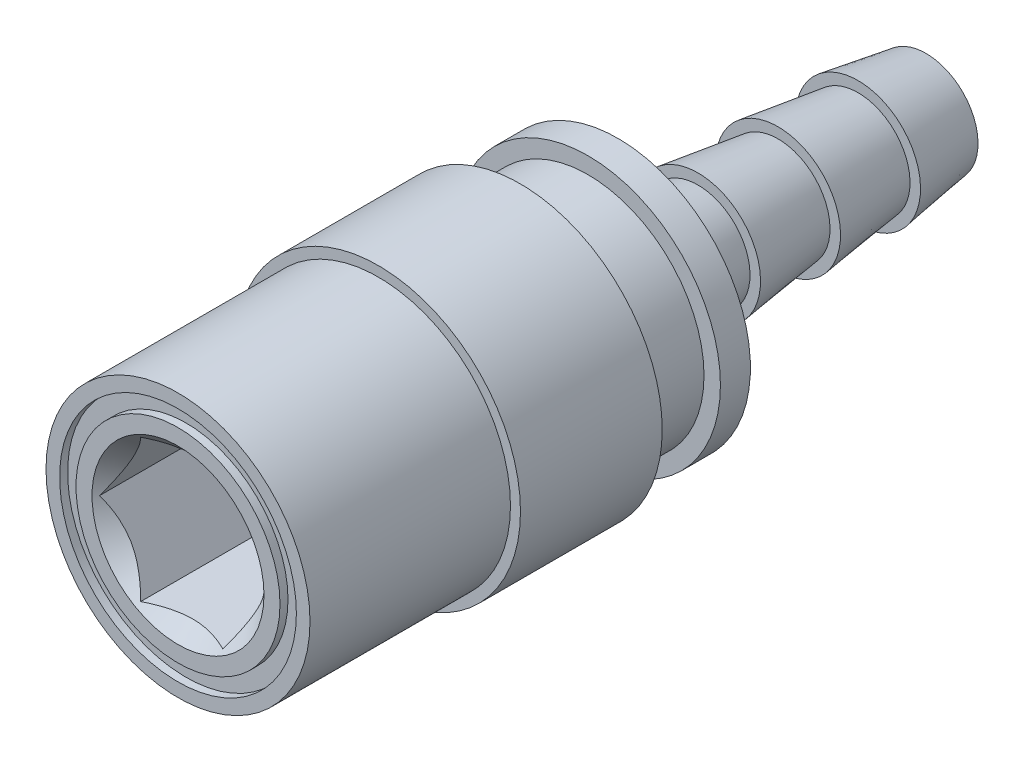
from build123d import *

# Parameters (mm, degrees)
SKETCH2_R           = 9.017
BOSS_EXTRUDE1_DEPTH = 27.94
SKETCH6_W           = 4.3053
SKETCH6_H           = 20
SKETCH11_R          = 7.517
SKETCH11_R_2        = 6.477
CUT_EXTRUDE3_DEPTH  = 0.508
SKETCH27_W          = 12.7297
SKETCH27_H          = 0.635
SKETCH32_OUTSIDE_W  = 27.6
SKETCH32_OUTSIDE_H  = 27.6
SKETCH32_OUTSIDE_R  = 8.4074
CUT_EXTRUDE4_DEPTH  = 2.54
CHAMFER1_SIZE       = 1.016
CUT_EXTRUDE5_DEPTH  = 12.7297


with BuildPart() as part:
    # Sketch2 → Boss-Extrude1 (new body)
    with BuildSketch(Plane.XY):
        Circle(SKETCH2_R)
    extrude(amount=-BOSS_EXTRUDE1_DEPTH)

    # Sketch6 → Cut-Revolve1 (revolve, cut)
    with BuildSketch(Plane(origin=(0, 0, 0), x_dir=(0, 0, -1), z_dir=(1, 0, 0)), mode=Mode.PRIVATE) as cut_revolve1_sk:
        with Locations((23.88235, 17.366)):
            Rectangle(SKETCH6_W, SKETCH6_H)
    revolve(cut_revolve1_sk.sketch.rotate(Axis((0, 0, 0), (0, 0, -1)), 90), axis=Axis((0, 0, 0), (0, 0, -1)), mode=Mode.SUBTRACT)

    # Sketch11 → Cut-Extrude3 (cut)
    with BuildSketch(Plane.XY):
        Circle(SKETCH11_R)
        Circle(SKETCH11_R_2, mode=Mode.SUBTRACT)
    extrude(amount=-CUT_EXTRUDE3_DEPTH, mode=Mode.SUBTRACT)

    # Sketch27 → Cut-Revolve5 (revolve, cut)
    with BuildSketch(Plane(origin=(0, 0, 0), x_dir=(0, 0, -1), z_dir=(1, 0, 0)), mode=Mode.PRIVATE) as cut_revolve5_sk:
        with Locations((6.36485, 8.6995)):
            Rectangle(SKETCH27_W, SKETCH27_H)
    revolve(cut_revolve5_sk.sketch.rotate(Axis((0, 0, 0), (0, 0, -1)), 90), axis=Axis((0, 0, 0), (0, 0, -1)), mode=Mode.SUBTRACT)

    # Sketch32 outside → Cut-Extrude4 (cut)
    with BuildSketch(Plane(origin=(0, 0, -27.94), x_dir=(-1, 0, 0), z_dir=(0, 0, -1))):
        Rectangle(SKETCH32_OUTSIDE_W, SKETCH32_OUTSIDE_H)
        Circle(SKETCH32_OUTSIDE_R, mode=Mode.SUBTRACT)
    extrude(amount=-CUT_EXTRUDE4_DEPTH, mode=Mode.SUBTRACT)

    # Sketch31 → Revolve4 (revolve)
    with BuildSketch(Plane(origin=(0, 0, 0), x_dir=(0, 0, -1), z_dir=(1, 0, 0)), mode=Mode.PRIVATE) as revolve4_sk:
        Polygon((47.498, 3.302), (43.18, 3.96875), (43.18, 3.302), (38.1, 3.96875), (38.1, 3.302), (33.02, 3.96875), (33.02, 3.302), (27.94, 3.96875), (27.94, 0), (47.498, 0), align=None)
    revolve(revolve4_sk.sketch.rotate(Axis((0, 0, -27.94), (0, 0, -1)), 180), axis=Axis((0, 0, -27.94), (0, 0, -1)))

    # Sketch29 → Cut-Revolve7 (revolve, cut)
    with BuildSketch(Plane(origin=(0, 0, 0), x_dir=(0, 0, -1), z_dir=(1, 0, 0)), mode=Mode.PRIVATE) as cut_revolve7_sk:
        Polygon((0, 0), (47.498, 0), (47.498, 2.3876), (26.035, 2.3876), (26.035, 3.96875), (12.7297, 3.96875), (12.7297, 4.445), (0, 4.445), align=None)
    revolve(cut_revolve7_sk.sketch.rotate(Axis((0, 0, 3.947771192), (0, 0, -1)), 90), axis=Axis((0, 0, 3.947771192), (0, 0, -1)), mode=Mode.SUBTRACT)

    # Chamfer1
    chamfer1_edges = [part.edges().sort_by_distance(p)[0] for p in [
        (-4.445, 0, 0),
    ]]
    chamfer(chamfer1_edges, length=CHAMFER1_SIZE)

    # Sketch33 → Cut-Extrude5 (cut)
    with BuildSketch(Plane.XY):
        Polygon((-2.610316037, 4.5212), (-5.220632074, 0), (-2.610316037, -4.5212), (2.610316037, -4.5212), (5.220632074, 0), (2.610316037, 4.5212), align=None)
    extrude(amount=-CUT_EXTRUDE5_DEPTH, mode=Mode.SUBTRACT)


solid = part.part
